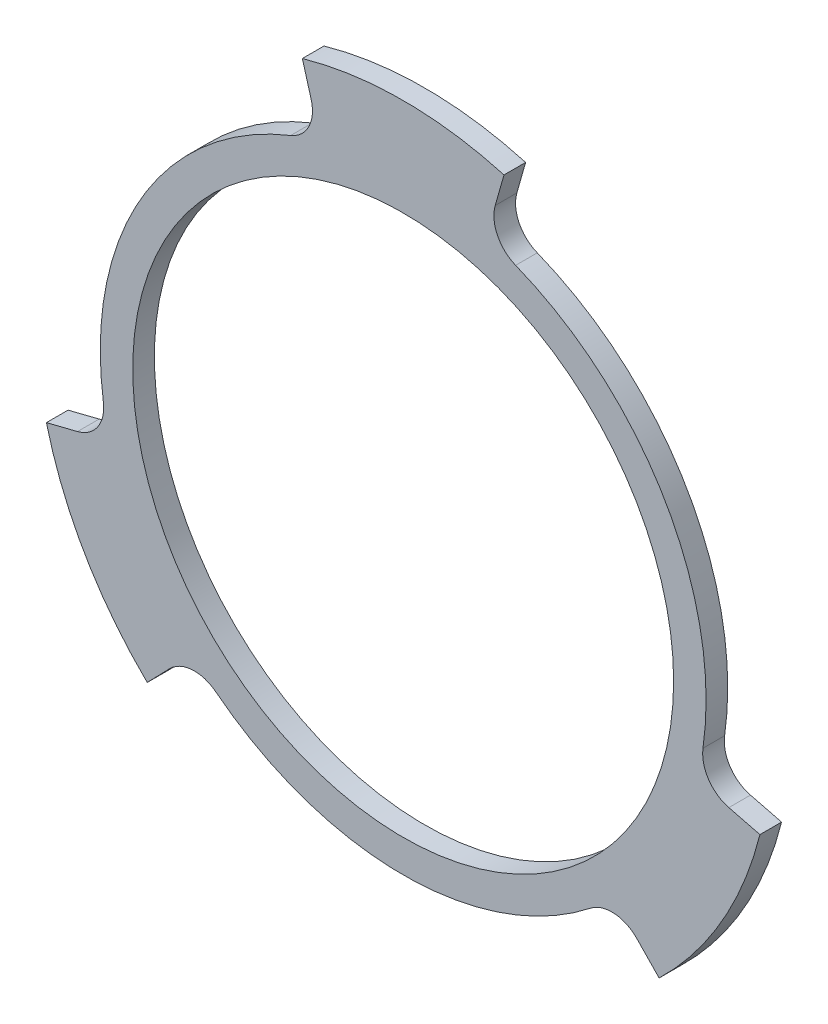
from build123d import *

# Parameters (mm, degrees)
SKETCH1_R      = 19.84375
EXTRUDE1_DEPTH = 1.5875
FILLET1_R      = 2.54


with BuildPart() as part:
    # Sketch1 → Extrude1 (new body)
    with BuildSketch(Plane.XY):
        with BuildLine():
            ThreePointArc((15.464443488, -15.962506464), (0, -22.225), (-15.464443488, -15.962506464))
            Line((-15.464443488, -15.962506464), (-18.778252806, -19.383043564))
            ThreePointArc((-18.778252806, -19.383043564), (-23.371860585, -13.49375), (-26.175334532, -6.570922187))
            Line((-26.175334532, -6.570922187), (-21.55615785, -5.411347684))
            ThreePointArc((-21.55615785, -5.411347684), (-19.247414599, 11.1125), (-6.091714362, 21.373854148))
            Line((-6.091714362, 21.373854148), (-7.397081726, 25.953965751))
            ThreePointArc((-7.397081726, 25.953965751), (0, 26.9875), (7.397081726, 25.953965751))
            Line((7.397081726, 25.953965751), (6.091714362, 21.373854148))
            ThreePointArc((6.091714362, 21.373854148), (19.247414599, 11.1125), (21.55615785, -5.411347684))
            Line((21.55615785, -5.411347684), (26.175334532, -6.570922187))
            ThreePointArc((26.175334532, -6.570922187), (23.371860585, -13.49375), (18.778252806, -19.383043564))
            Line((18.778252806, -19.383043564), (15.464443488, -15.962506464))
        make_face()
        Circle(SKETCH1_R, mode=Mode.SUBTRACT)
    extrude(amount=EXTRUDE1_DEPTH)

    # Fillet1
    fillet1_edges = [part.edges().sort_by_distance(p)[0] for p in [
        (-15.464443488, -15.962506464, 0.79375),
        (-21.55615785, -5.411347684, 0.79375),
        (-6.091714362, 21.373854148, 0.79375),
        (6.091714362, 21.373854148, 0.79375),
        (21.55615785, -5.411347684, 0.79375),
        (15.464443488, -15.962506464, 0.79375),
    ]]
    fillet(fillet1_edges, radius=FILLET1_R)


solid = part.part
